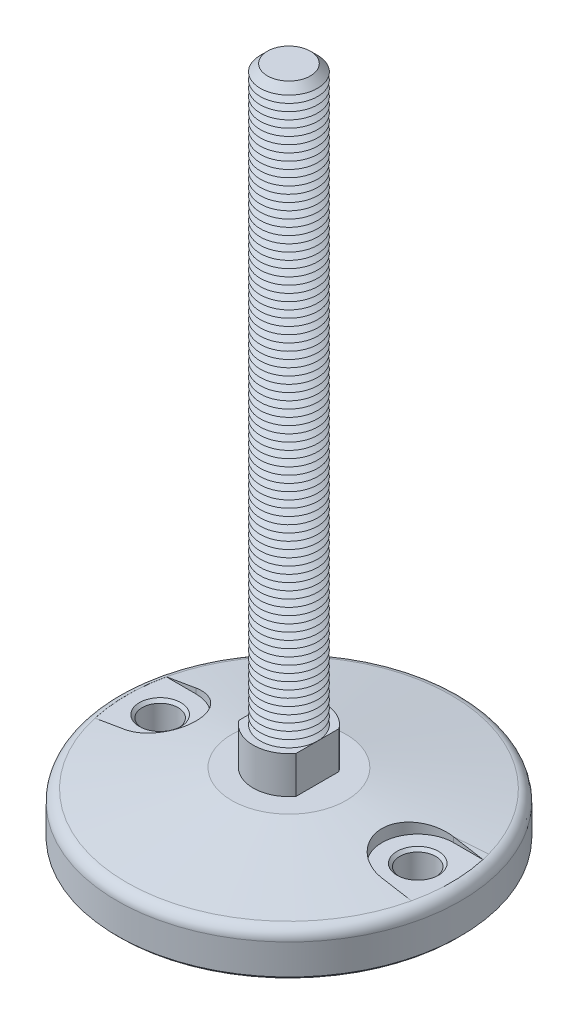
from build123d import *

# Parameters (mm, degrees)
FILLET1_R                = 4
SKETCH3_R                = 12.5
BOSS_EXTRUDE1_DEPTH      = 13
CUT_EXTRUDE1_START       = -13
CUT_EXTRUDE1_DEPTH       = 13
SKETCH5_R                = 10
BOSS_EXTRUDE2_DEPTH      = 200
CHAMFER1_SIZE            = 2.5
LPATTERN1_COUNT          = 79
LPATTERN1_PITCH          = 2.5
CUT_EXTRUDE4_DEPTH       = 6.5
SKETCH10_R               = 6.25
CUT_EXTRUDE5_DEPTH       = 15.5
CHAMFER2_SIZE            = 1
CHAMFER2_OF_MIRROR1_SIZE = 1
CHAMFER3_SIZE            = 1


with BuildPart() as part:
    # Sketch2 → Revolve1 (revolve)
    with BuildSketch(Plane(origin=(0, 0, 0), x_dir=(0, 0, -1), z_dir=(1, 0, 0)), mode=Mode.PRIVATE) as revolve1_sk:
        Polygon((0, 0), (-20, 0), (-60, -7.053079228), (-60, -22), (0, -22), align=None)
    revolve(revolve1_sk.sketch.rotate(Axis((0, 61.338865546, 0), (0, -1, 0)), 180), axis=Axis((0, 61.338865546, 0), (0, -1, 0)))

    # Fillet1
    fillet1_edges = [part.edges().sort_by_distance(p)[0] for p in [
        (0, -7.053079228, 60),
    ]]
    fillet(fillet1_edges, radius=FILLET1_R)

    # Sketch3 → Boss-Extrude1 (add)
    with BuildSketch(Plane(origin=(0, 0, 0), x_dir=(1, 0, 0), z_dir=(0, 1, 0))):
        with Locations(Location((0, 0, 0), (0, 0, 90))):
            Circle(SKETCH3_R)
    extrude(amount=BOSS_EXTRUDE1_DEPTH)

    # Sketch4 → Cut-Extrude1 (cut)
    with BuildSketch(Plane(origin=(0, 13, 0), x_dir=(1, 0, 0), z_dir=(0, 1, 0)).offset(CUT_EXTRUDE1_START)):
        with BuildLine():
            Line((-10, 7.5), (-10, -7.5))
            ThreePointArc((-10, -7.5), (-12.5, 0), (-10, 7.5))
        make_face()
        with BuildLine():
            Line((10, -7.5), (10, 7.5))
            ThreePointArc((10, 7.5), (12.5, 0), (10, -7.5))
        make_face()
    extrude(amount=CUT_EXTRUDE1_DEPTH, mode=Mode.SUBTRACT)

    # Sketch5 → Boss-Extrude2 (add)
    with BuildSketch(Plane(origin=(0, 13, 0), x_dir=(1, 0, 0), z_dir=(0, 1, 0))):
        with Locations(Location((0, 0, 0), (0, 0, 180))):
            Circle(SKETCH5_R)
    extrude(amount=BOSS_EXTRUDE2_DEPTH)

    # Chamfer1
    chamfer1_edges = [part.edges().sort_by_distance(p)[0] for p in [
        (10, 213, 0),
    ]]
    chamfer(chamfer1_edges, length=CHAMFER1_SIZE)

    # Sketch6 → Cut-Revolve1 (revolve, cut)
    with BuildSketch(Plane(origin=(0, 0, 0), x_dir=(0, 0, -1), z_dir=(1, 0, 0))):
        Polygon((-10, 13), (-7.834936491, 14.25), (-10, 15.5), align=None)
    cut_revolve1 = revolve(axis=Axis((0, 61.338865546, 0), (0, -1, 0)), mode=Mode.SUBTRACT)

    # LPattern1: Cut-Revolve1 ×79
    with Locations(*[(0, i * LPATTERN1_PITCH, 0) for i in range(1, LPATTERN1_COUNT)]):
        add(cut_revolve1, mode=Mode.SUBTRACT)

    # Sketch8 → Cut-Extrude4 (cut)
    with BuildSketch(Plane(origin=(0, 0, 0), x_dir=(1, 0, 0), z_dir=(0, 1, 0))):
        with BuildLine():
            Line((-45, 12.5), (-55.299428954, 12.5))
            ThreePointArc((-55.299428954, 12.5), (-56.694592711, 0), (-55.299428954, -12.5))
            Line((-55.299428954, -12.5), (-45, -12.5))
            ThreePointArc((-45, -12.5), (-32.5, 0), (-45, 12.5))
        make_face()
    cut_extrude4 = extrude(amount=-CUT_EXTRUDE4_DEPTH, mode=Mode.SUBTRACT)

    # Sketch10 → Cut-Extrude5 (cut)
    with BuildSketch(Plane(origin=(0, -6.5, 0), x_dir=(1, 0, 0), z_dir=(0, 1, 0))):
        with Locations(Location((-45, 0, 0), (0, 0, 270))):
            Circle(SKETCH10_R)
    cut_extrude5 = extrude(amount=-CUT_EXTRUDE5_DEPTH, mode=Mode.SUBTRACT)

    # Chamfer2
    chamfer2_edges = [part.edges().sort_by_distance(p)[0] for p in [
        (-45, -6.5, -6.25),
        (-45, -22, -6.25),
    ]]
    chamfer(chamfer2_edges, length=CHAMFER2_SIZE)

    # Mirror1: Cut-Extrude4, Cut-Extrude5 across plane
    add(cut_extrude4.mirror(Plane(origin=(0, 0, 0), x_dir=(0, 0, 1), z_dir=(1, 0, 0))), mode=Mode.SUBTRACT)
    add(cut_extrude5.mirror(Plane(origin=(0, 0, 0), x_dir=(0, 0, 1), z_dir=(1, 0, 0))), mode=Mode.SUBTRACT)

    # Chamfer2 of Mirror1
    chamfer2_of_mirror1_edges = [part.edges().sort_by_distance(p)[0] for p in [
        (45, -6.5, -6.25),
        (45, -22, -6.25),
    ]]
    chamfer(chamfer2_of_mirror1_edges, length=CHAMFER2_OF_MIRROR1_SIZE)

    # Chamfer3
    chamfer3_edges = [part.edges().sort_by_distance(p)[0] for p in [
        (0, -22, 60),
    ]]
    chamfer(chamfer3_edges, length=CHAMFER3_SIZE)


solid = part.part
